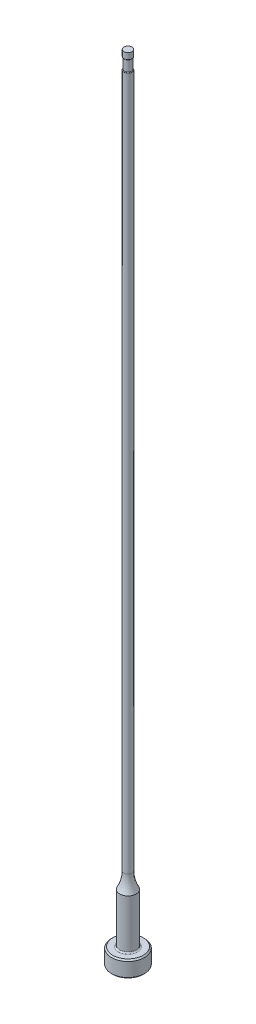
ISO-10303-21;
HEADER;
FILE_DESCRIPTION(('STEP AP214'),'2;1');
FILE_NAME('part.step','',(''),(''),'','','');
FILE_SCHEMA(('AUTOMOTIVE_DESIGN { 1 0 10303 214 1 1 1 1 }'));
ENDSEC;
DATA;
#1=APPLICATION_CONTEXT('core data for automotive mechanical design processes');
#2=APPLICATION_PROTOCOL_DEFINITION('international standard','automotive_design',2000,#1);
#3=PRODUCT_CONTEXT('',#1,'mechanical');
#4=PRODUCT('Part','Part','',(#3));
#5=PRODUCT_RELATED_PRODUCT_CATEGORY('part','',(#4));
#6=PRODUCT_DEFINITION_FORMATION('','',#4);
#7=PRODUCT_DEFINITION_CONTEXT('part definition',#1,'design');
#8=PRODUCT_DEFINITION('design','',#6,#7);
#9=PRODUCT_DEFINITION_SHAPE('','',#8);
#10=(LENGTH_UNIT() NAMED_UNIT(*) SI_UNIT(.MILLI.,.METRE.));
#11=(NAMED_UNIT(*) PLANE_ANGLE_UNIT() SI_UNIT($,.RADIAN.));
#12=(NAMED_UNIT(*) SI_UNIT($,.STERADIAN.) SOLID_ANGLE_UNIT());
#13=UNCERTAINTY_MEASURE_WITH_UNIT(LENGTH_MEASURE(1.E-05),#10,'distance_accuracy_value','');
#14=(GEOMETRIC_REPRESENTATION_CONTEXT(3) GLOBAL_UNCERTAINTY_ASSIGNED_CONTEXT((#13)) GLOBAL_UNIT_ASSIGNED_CONTEXT((#10,
#11,#12)) REPRESENTATION_CONTEXT('',''));
#15=CARTESIAN_POINT('',(0.,0.,0.));
#16=DIRECTION('',(0.,0.,1.));
#17=DIRECTION('',(1.,0.,0.));
#18=AXIS2_PLACEMENT_3D('',#15,#16,#17);
#19=CARTESIAN_POINT('',(0.,259.958771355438,0.));
#20=DIRECTION('',(0.,1.,0.));
#21=DIRECTION('',(0.,0.,1.));
#22=AXIS2_PLACEMENT_3D('',#19,#20,#21);
#23=CYLINDRICAL_SURFACE('',#22,0.79374999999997);
#24=DIRECTION('',(0.,1.,0.));
#25=VECTOR('',#24,1.);
#26=CARTESIAN_POINT('',(-0.692149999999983,259.958771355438,-0.388545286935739));
#27=LINE('',#26,#25);
#28=CARTESIAN_POINT('',(-0.692149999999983,148.973565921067,-0.388545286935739));
#29=VERTEX_POINT('',#28);
#30=CARTESIAN_POINT('',(-0.692149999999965,112.014,-0.388545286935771));
#31=VERTEX_POINT('',#30);
#32=EDGE_CURVE('E66',#29,#31,#27,.F.);
#33=ORIENTED_EDGE('',*,*,#32,.F.);
#34=CARTESIAN_POINT('',(0.,148.973565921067,0.));
#35=DIRECTION('',(0.,1.,0.));
#36=DIRECTION('',(0.,0.,1.));
#37=AXIS2_PLACEMENT_3D('',#34,#35,#36);
#38=CIRCLE('',#37,0.79374999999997);
#39=CARTESIAN_POINT('',(-0.692149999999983,148.973565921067,0.388545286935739));
#40=VERTEX_POINT('',#39);
#41=EDGE_CURVE('E44',#29,#40,#38,.F.);
#42=ORIENTED_EDGE('',*,*,#41,.T.);
#43=DIRECTION('',(0.,1.,0.));
#44=VECTOR('',#43,1.);
#45=CARTESIAN_POINT('',(-0.692149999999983,259.958771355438,0.388545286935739));
#46=LINE('',#45,#44);
#47=CARTESIAN_POINT('',(-0.692149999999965,112.014,0.388545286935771));
#48=VERTEX_POINT('',#47);
#49=EDGE_CURVE('E72',#48,#40,#46,.T.);
#50=ORIENTED_EDGE('',*,*,#49,.F.);
#51=CARTESIAN_POINT('',(-0.692149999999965,112.014,-0.388545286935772));
#52=CARTESIAN_POINT('',(-0.692147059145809,111.980595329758,-0.388529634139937));
#53=CARTESIAN_POINT('',(-0.692677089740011,111.947184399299,-0.387605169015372));
#54=CARTESIAN_POINT('',(-0.694785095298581,111.880441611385,-0.383825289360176));
#55=CARTESIAN_POINT('',(-0.696365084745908,111.847110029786,-0.380966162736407));
#56=CARTESIAN_POINT('',(-0.700560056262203,111.780665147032,-0.373193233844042));
#57=CARTESIAN_POINT('',(-0.703177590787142,111.747552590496,-0.368274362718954));
#58=CARTESIAN_POINT('',(-0.70939790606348,111.681866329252,-0.356147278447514));
#59=CARTESIAN_POINT('',(-0.712999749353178,111.649292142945,-0.348941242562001));
#60=CARTESIAN_POINT('',(-0.720516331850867,111.589629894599,-0.333107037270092));
#61=CARTESIAN_POINT('',(-0.724309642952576,111.562432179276,-0.324837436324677));
#62=CARTESIAN_POINT('',(-0.732469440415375,111.508890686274,-0.305996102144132));
#63=CARTESIAN_POINT('',(-0.736836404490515,111.482547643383,-0.295422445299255));
#64=CARTESIAN_POINT('',(-0.746025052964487,111.430994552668,-0.271391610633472));
#65=CARTESIAN_POINT('',(-0.75085027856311,111.405796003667,-0.257910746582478));
#66=CARTESIAN_POINT('',(-0.760636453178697,111.357650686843,-0.227438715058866));
#67=CARTESIAN_POINT('',(-0.765596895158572,111.334696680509,-0.210459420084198));
#68=CARTESIAN_POINT('',(-0.772863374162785,111.302559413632,-0.181185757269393));
#69=CARTESIAN_POINT('',(-0.775317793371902,111.291987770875,-0.170459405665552));
#70=CARTESIAN_POINT('',(-0.779981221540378,111.272302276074,-0.147661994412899));
#71=CARTESIAN_POINT('',(-0.782190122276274,111.263189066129,-0.135590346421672));
#72=CARTESIAN_POINT('',(-0.786212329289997,111.24684932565,-0.10990918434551));
#73=CARTESIAN_POINT('',(-0.788019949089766,111.239649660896,-0.0962812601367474));
#74=CARTESIAN_POINT('',(-0.790974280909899,111.227994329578,-0.0678329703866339));
#75=CARTESIAN_POINT('',(-0.792122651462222,111.223531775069,-0.0530157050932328));
#76=CARTESIAN_POINT('',(-0.793477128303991,111.218282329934,-0.0246588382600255));
#77=CARTESIAN_POINT('',(-0.793785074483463,111.217097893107,-0.0111986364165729));
#78=CARTESIAN_POINT('',(-0.793708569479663,111.217392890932,0.0156909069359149));
#79=CARTESIAN_POINT('',(-0.793324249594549,111.218871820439,0.0291202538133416));
#80=CARTESIAN_POINT('',(-0.792034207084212,111.223877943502,0.0533347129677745));
#81=CARTESIAN_POINT('',(-0.791220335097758,111.227045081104,0.064202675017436));
#82=CARTESIAN_POINT('',(-0.789221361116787,111.234900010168,0.0853309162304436));
#83=CARTESIAN_POINT('',(-0.78803617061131,111.239588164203,0.0955910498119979));
#84=CARTESIAN_POINT('',(-0.784691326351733,111.252986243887,0.120537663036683));
#85=CARTESIAN_POINT('',(-0.782345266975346,111.262520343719,0.134755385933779));
#86=CARTESIAN_POINT('',(-0.777271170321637,111.283662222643,0.161475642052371));
#87=CARTESIAN_POINT('',(-0.774542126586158,111.295275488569,0.173973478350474));
#88=CARTESIAN_POINT('',(-0.76709792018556,111.327902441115,0.204925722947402));
#89=CARTESIAN_POINT('',(-0.762235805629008,111.350152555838,0.222031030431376));
#90=CARTESIAN_POINT('',(-0.752599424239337,111.396926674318,0.252764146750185));
#91=CARTESIAN_POINT('',(-0.747825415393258,111.421456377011,0.26638290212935));
#92=CARTESIAN_POINT('',(-0.734693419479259,111.493796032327,0.30145019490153));
#93=CARTESIAN_POINT('',(-0.726816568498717,111.543351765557,0.319450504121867));
#94=CARTESIAN_POINT('',(-0.713277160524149,111.644727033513,0.348596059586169));
#95=CARTESIAN_POINT('',(-0.707621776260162,111.696553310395,0.359719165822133));
#96=CARTESIAN_POINT('',(-0.699557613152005,111.792820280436,0.375130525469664));
#97=CARTESIAN_POINT('',(-0.696772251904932,111.837103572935,0.380231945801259));
#98=CARTESIAN_POINT('',(-0.693072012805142,111.925601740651,0.386898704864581));
#99=CARTESIAN_POINT('',(-0.692139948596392,111.969813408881,0.388496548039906));
#100=CARTESIAN_POINT('',(-0.692149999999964,112.014,0.388545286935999));
#101=B_SPLINE_CURVE_WITH_KNOTS('',3,(#51,#52,#53,#54,#55,#56,#57,#58,#59,#60,#61,#62,#63,#64,
#65,#66,#67,#68,#69,#70,#71,#72,#73,#74,#75,#76,#77,#78,#79,#80,#81,#82,#83,#84,#85,#86,#87,#88,
#89,#90,#91,#92,#93,#94,#95,#96,#97,#98,#99,#100),.UNSPECIFIED.,.F.,.F.,(4,2,2,2,2,2,2,2,2,2,2,
2,2,2,2,2,2,2,2,2,2,2,2,2,4),(0.,0.100207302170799,0.20060742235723,0.30125608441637,
0.401809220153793,0.487757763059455,0.573778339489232,0.660528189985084,0.746988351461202,
0.792665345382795,0.838362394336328,0.884670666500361,0.930861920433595,0.971137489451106,
1.01140542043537,1.04531885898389,1.0792403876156,1.13077999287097,1.1824576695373,
1.26742509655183,1.35261096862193,1.51165072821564,1.67119985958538,1.80500866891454,
1.93757071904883),.UNSPECIFIED.);
#102=EDGE_CURVE('E74',#31,#48,#101,.T.);
#103=ORIENTED_EDGE('',*,*,#102,.F.);
#104=EDGE_LOOP('',(#33,#42,#50,#103));
#105=FACE_BOUND('',#104,.T.);
#106=CARTESIAN_POINT('',(0.,15.7741805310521,0.));
#107=DIRECTION('',(0.,1.,0.));
#108=DIRECTION('',(0.,0.,1.));
#109=AXIS2_PLACEMENT_3D('',#106,#107,#108);
#110=CIRCLE('',#109,0.79374999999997);
#111=CARTESIAN_POINT('',(0.,15.7741805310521,0.79374999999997));
#112=VERTEX_POINT('',#111);
#113=EDGE_CURVE('E95',#112,#112,#110,.T.);
#114=ORIENTED_EDGE('',*,*,#113,.T.);
#115=EDGE_LOOP('',(#114));
#116=FACE_BOUND('',#115,.T.);
#117=ADVANCED_FACE('F36',(#105,#116),#23,.T.);
#118=CARTESIAN_POINT('',(0.,15.7741805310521,0.));
#119=DIRECTION('',(0.,1.,0.));
#120=DIRECTION('',(0.,0.,1.));
#121=AXIS2_PLACEMENT_3D('',#118,#119,#120);
#122=TOROIDAL_SURFACE('',#121,7.14374999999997,6.35);
#123=CARTESIAN_POINT('',(0.,12.7,0.));
#124=DIRECTION('',(0.,1.,0.));
#125=DIRECTION('',(0.,0.,1.));
#126=AXIS2_PLACEMENT_3D('',#123,#124,#125);
#127=CIRCLE('',#126,1.58749999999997);
#128=CARTESIAN_POINT('',(0.,12.7,1.58749999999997));
#129=VERTEX_POINT('',#128);
#130=EDGE_CURVE('E92',#129,#129,#127,.T.);
#131=ORIENTED_EDGE('',*,*,#130,.T.);
#132=EDGE_LOOP('',(#131));
#133=FACE_BOUND('',#132,.T.);
#134=ORIENTED_EDGE('',*,*,#113,.F.);
#135=EDGE_LOOP('',(#134));
#136=FACE_BOUND('',#135,.T.);
#137=ADVANCED_FACE('F156',(#133,#136),#122,.F.);
#138=CARTESIAN_POINT('',(0.,259.958771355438,0.));
#139=DIRECTION('',(0.,1.,0.));
#140=DIRECTION('',(0.,0.,1.));
#141=AXIS2_PLACEMENT_3D('',#138,#139,#140);
#142=CYLINDRICAL_SURFACE('',#141,1.58749999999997);
#143=CARTESIAN_POINT('',(0.,3.42900000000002,0.));
#144=DIRECTION('',(0.,1.,0.));
#145=DIRECTION('',(0.,0.,1.));
#146=AXIS2_PLACEMENT_3D('',#143,#144,#145);
#147=CIRCLE('',#146,1.58749999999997);
#148=CARTESIAN_POINT('',(0.,3.42900000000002,1.58749999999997));
#149=VERTEX_POINT('',#148);
#150=EDGE_CURVE('E110',#149,#149,#147,.T.);
#151=ORIENTED_EDGE('',*,*,#150,.T.);
#152=EDGE_LOOP('',(#151));
#153=FACE_BOUND('',#152,.T.);
#154=ORIENTED_EDGE('',*,*,#130,.F.);
#155=EDGE_LOOP('',(#154));
#156=FACE_BOUND('',#155,.T.);
#157=ADVANCED_FACE('F153',(#153,#156),#142,.T.);
#158=CARTESIAN_POINT('',(-3.17499999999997,3.175,0.));
#159=DIRECTION('',(0.,1.,0.));
#160=DIRECTION('',(0.,0.,1.));
#161=AXIS2_PLACEMENT_3D('',#158,#159,#160);
#162=PLANE('',#161);
#163=CARTESIAN_POINT('',(0.,3.175,0.));
#164=DIRECTION('',(0.,1.,0.));
#165=DIRECTION('',(0.,0.,1.));
#166=AXIS2_PLACEMENT_3D('',#163,#164,#165);
#167=CIRCLE('',#166,1.84149999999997);
#168=CARTESIAN_POINT('',(0.,3.175,1.84149999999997));
#169=VERTEX_POINT('',#168);
#170=EDGE_CURVE('E78',#169,#169,#167,.F.);
#171=ORIENTED_EDGE('',*,*,#170,.T.);
#172=EDGE_LOOP('',(#171));
#173=FACE_BOUND('',#172,.T.);
#174=CARTESIAN_POINT('',(0.,3.175,0.));
#175=DIRECTION('',(0.,1.,0.));
#176=DIRECTION('',(0.,0.,1.));
#177=AXIS2_PLACEMENT_3D('',#174,#175,#176);
#178=CIRCLE('',#177,2.92099999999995);
#179=CARTESIAN_POINT('',(0.,3.175,2.92099999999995));
#180=VERTEX_POINT('',#179);
#181=EDGE_CURVE('E98',#180,#180,#178,.T.);
#182=ORIENTED_EDGE('',*,*,#181,.T.);
#183=EDGE_LOOP('',(#182));
#184=FACE_BOUND('',#183,.T.);
#185=ADVANCED_FACE('F149',(#173,#184),#162,.T.);
#186=CARTESIAN_POINT('',(0.,259.958771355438,0.));
#187=DIRECTION('',(0.,1.,0.));
#188=DIRECTION('',(0.,0.,1.));
#189=AXIS2_PLACEMENT_3D('',#186,#187,#188);
#190=CYLINDRICAL_SURFACE('',#189,3.17499999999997);
#191=CARTESIAN_POINT('',(0.,2.92100000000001,0.));
#192=DIRECTION('',(0.,1.,0.));
#193=DIRECTION('',(0.,0.,1.));
#194=AXIS2_PLACEMENT_3D('',#191,#192,#193);
#195=CIRCLE('',#194,3.17499999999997);
#196=CARTESIAN_POINT('',(0.,2.92100000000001,3.17499999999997));
#197=VERTEX_POINT('',#196);
#198=EDGE_CURVE('E104',#197,#197,#195,.F.);
#199=ORIENTED_EDGE('',*,*,#198,.T.);
#200=EDGE_LOOP('',(#199));
#201=FACE_BOUND('',#200,.T.);
#202=CARTESIAN_POINT('',(0.,0.254000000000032,0.));
#203=DIRECTION('',(0.,-1.,0.));
#204=DIRECTION('',(0.,0.,-1.));
#205=AXIS2_PLACEMENT_3D('',#202,#203,#204);
#206=CIRCLE('',#205,3.17499999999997);
#207=CARTESIAN_POINT('',(0.,0.254000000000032,-3.17499999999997));
#208=VERTEX_POINT('',#207);
#209=EDGE_CURVE('E101',#208,#208,#206,.F.);
#210=ORIENTED_EDGE('',*,*,#209,.T.);
#211=EDGE_LOOP('',(#210));
#212=FACE_BOUND('',#211,.T.);
#213=ADVANCED_FACE('F145',(#201,#212),#190,.T.);
#214=CARTESIAN_POINT('',(0.,0.,0.));
#215=DIRECTION('',(0.,-1.,0.));
#216=DIRECTION('',(0.,0.,-1.));
#217=AXIS2_PLACEMENT_3D('',#214,#215,#216);
#218=PLANE('',#217);
#219=CARTESIAN_POINT('',(0.,0.,0.));
#220=DIRECTION('',(0.,-1.,0.));
#221=DIRECTION('',(0.,0.,-1.));
#222=AXIS2_PLACEMENT_3D('',#219,#220,#221);
#223=CIRCLE('',#222,2.92099999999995);
#224=CARTESIAN_POINT('',(0.,0.,-2.92099999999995));
#225=VERTEX_POINT('',#224);
#226=EDGE_CURVE('E107',#225,#225,#223,.T.);
#227=ORIENTED_EDGE('',*,*,#226,.T.);
#228=EDGE_LOOP('',(#227));
#229=FACE_BOUND('',#228,.T.);
#230=ADVANCED_FACE('F141',(#229),#218,.T.);
#231=CARTESIAN_POINT('',(0.,3.17499999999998,0.));
#232=DIRECTION('',(0.,-1.,0.));
#233=DIRECTION('',(0.,0.,-1.));
#234=AXIS2_PLACEMENT_3D('',#231,#232,#233);
#235=CONICAL_SURFACE('',#234,2.92099999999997,0.7853981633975);
#236=ORIENTED_EDGE('',*,*,#198,.F.);
#237=EDGE_LOOP('',(#236));
#238=FACE_BOUND('',#237,.T.);
#239=ORIENTED_EDGE('',*,*,#181,.F.);
#240=EDGE_LOOP('',(#239));
#241=FACE_BOUND('',#240,.T.);
#242=ADVANCED_FACE('F144',(#238,#241),#235,.T.);
#243=CARTESIAN_POINT('',(0.,0.254000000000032,0.));
#244=DIRECTION('',(0.,1.,0.));
#245=DIRECTION('',(0.,0.,1.));
#246=AXIS2_PLACEMENT_3D('',#243,#244,#245);
#247=CONICAL_SURFACE('',#246,3.17499999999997,0.785398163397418);
#248=ORIENTED_EDGE('',*,*,#226,.F.);
#249=EDGE_LOOP('',(#248));
#250=FACE_BOUND('',#249,.T.);
#251=ORIENTED_EDGE('',*,*,#209,.F.);
#252=EDGE_LOOP('',(#251));
#253=FACE_BOUND('',#252,.T.);
#254=ADVANCED_FACE('F245',(#250,#253),#247,.T.);
#255=CARTESIAN_POINT('',(0.,3.42900000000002,0.));
#256=DIRECTION('',(0.,1.,0.));
#257=DIRECTION('',(0.,0.,1.));
#258=AXIS2_PLACEMENT_3D('',#255,#256,#257);
#259=TOROIDAL_SURFACE('',#258,1.84149999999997,0.254);
#260=ORIENTED_EDGE('',*,*,#170,.F.);
#261=EDGE_LOOP('',(#260));
#262=FACE_BOUND('',#261,.T.);
#263=ORIENTED_EDGE('',*,*,#150,.F.);
#264=EDGE_LOOP('',(#263));
#265=FACE_BOUND('',#264,.T.);
#266=ADVANCED_FACE('F139',(#262,#265),#259,.F.);
#267=CARTESIAN_POINT('',(0.,153.448281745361,0.));
#268=DIRECTION('',(0.,1.,0.));
#269=DIRECTION('',(0.,0.,1.));
#270=AXIS2_PLACEMENT_3D('',#267,#268,#269);
#271=CYLINDRICAL_SURFACE('',#270,0.69214999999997);
#272=CARTESIAN_POINT('',(0.,151.13,0.));
#273=DIRECTION('',(0.,1.,0.));
#274=DIRECTION('',(0.,0.,1.));
#275=AXIS2_PLACEMENT_3D('',#272,#273,#274);
#276=CIRCLE('',#275,0.69214999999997);
#277=CARTESIAN_POINT('',(0.,151.13,0.69214999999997));
#278=VERTEX_POINT('',#277);
#279=EDGE_CURVE('E71',#278,#278,#276,.T.);
#280=ORIENTED_EDGE('',*,*,#279,.F.);
#281=EDGE_LOOP('',(#280));
#282=FACE_BOUND('',#281,.T.);
#283=CARTESIAN_POINT('',(0.,149.098,0.));
#284=DIRECTION('',(0.,1.,0.));
#285=DIRECTION('',(0.,0.,1.));
#286=AXIS2_PLACEMENT_3D('',#283,#284,#285);
#287=CIRCLE('',#286,0.69214999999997);
#288=CARTESIAN_POINT('',(-0.69214999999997,149.098,0.));
#289=VERTEX_POINT('',#288);
#290=EDGE_CURVE('E89',#289,#289,#287,.T.);
#291=ORIENTED_EDGE('',*,*,#290,.T.);
#292=EDGE_LOOP('',(#291));
#293=FACE_BOUND('',#292,.T.);
#294=ADVANCED_FACE('F136',(#282,#293),#271,.T.);
#295=CARTESIAN_POINT('',(-0.69214999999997,150.114,-3.17499999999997));
#296=DIRECTION('',(1.,0.,0.));
#297=DIRECTION('',(0.,1.,0.));
#298=AXIS2_PLACEMENT_3D('',#295,#296,#297);
#299=PLANE('',#298);
#300=CARTESIAN_POINT('',(-0.692149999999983,148.973565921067,0.388545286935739));
#301=CARTESIAN_POINT('',(-0.692149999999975,148.977289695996,0.38855392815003));
#302=CARTESIAN_POINT('',(-0.692149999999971,148.981004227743,0.388211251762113));
#303=CARTESIAN_POINT('',(-0.692149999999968,148.988289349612,0.386898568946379));
#304=CARTESIAN_POINT('',(-0.692149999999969,148.991860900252,0.38593396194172));
#305=CARTESIAN_POINT('',(-0.69214999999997,148.998791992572,0.383453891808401));
#306=CARTESIAN_POINT('',(-0.69214999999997,149.00215209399,0.381939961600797));
#307=CARTESIAN_POINT('',(-0.69214999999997,149.00863226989,0.378456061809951));
#308=CARTESIAN_POINT('',(-0.69214999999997,149.011751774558,0.376485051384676));
#309=CARTESIAN_POINT('',(-0.69214999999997,149.01966563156,0.370784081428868));
#310=CARTESIAN_POINT('',(-0.69214999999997,149.024235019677,0.366742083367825));
#311=CARTESIAN_POINT('',(-0.69214999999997,149.032692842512,0.358002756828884));
#312=CARTESIAN_POINT('',(-0.69214999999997,149.036579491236,0.353303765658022));
#313=CARTESIAN_POINT('',(-0.69214999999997,149.046363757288,0.339903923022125));
#314=CARTESIAN_POINT('',(-0.69214999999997,149.051670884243,0.330775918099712));
#315=CARTESIAN_POINT('',(-0.69214999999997,149.060938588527,0.311873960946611));
#316=CARTESIAN_POINT('',(-0.69214999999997,149.064895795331,0.302098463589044));
#317=CARTESIAN_POINT('',(-0.69214999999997,149.07335470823,0.277716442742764));
#318=CARTESIAN_POINT('',(-0.69214999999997,149.07729702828,0.262919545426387));
#319=CARTESIAN_POINT('',(-0.69214999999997,149.083750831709,0.233007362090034));
#320=CARTESIAN_POINT('',(-0.69214999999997,149.086258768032,0.21789138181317));
#321=CARTESIAN_POINT('',(-0.69214999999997,149.092375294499,0.172181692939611));
#322=CARTESIAN_POINT('',(-0.69214999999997,149.094529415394,0.141404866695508));
#323=CARTESIAN_POINT('',(-0.69214999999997,149.096692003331,0.0920701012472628));
#324=CARTESIAN_POINT('',(-0.69214999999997,149.097212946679,0.0735164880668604));
#325=CARTESIAN_POINT('',(-0.69214999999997,149.097853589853,0.0366435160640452));
#326=CARTESIAN_POINT('',(-0.69214999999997,149.097978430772,0.0183242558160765));
#327=CARTESIAN_POINT('',(-0.69214999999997,149.098,0.));
#328=B_SPLINE_CURVE_WITH_KNOTS('',3,(#300,#301,#302,#303,#304,#305,#306,#307,#308,#309,#310,
#311,#312,#313,#314,#315,#316,#317,#318,#319,#320,#321,#322,#323,#324,#325,#326,#327),
.UNSPECIFIED.,.F.,.F.,(4,2,2,2,2,2,2,2,2,2,2,2,2,4),(0.,0.0111408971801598,0.0221863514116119,
0.0332012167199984,0.0442414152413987,0.0624374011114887,0.0806802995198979,0.112177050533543,
0.143751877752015,0.189567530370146,0.235495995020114,0.327902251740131,0.383589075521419,
0.438550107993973),.UNSPECIFIED.);
#329=EDGE_CURVE('E77',#40,#289,#328,.T.);
#330=ORIENTED_EDGE('',*,*,#329,.T.);
#331=CARTESIAN_POINT('',(-0.69214999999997,149.098,0.));
#332=CARTESIAN_POINT('',(-0.69214999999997,149.097997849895,-0.0105245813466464));
#333=CARTESIAN_POINT('',(-0.69214999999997,149.097951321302,-0.0210488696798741));
#334=CARTESIAN_POINT('',(-0.69214999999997,149.09775049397,-0.0420982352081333));
#335=CARTESIAN_POINT('',(-0.69214999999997,149.097596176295,-0.0526233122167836));
#336=CARTESIAN_POINT('',(-0.69214999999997,149.096939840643,-0.0843503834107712));
#337=CARTESIAN_POINT('',(-0.69214999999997,149.096243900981,-0.105550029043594));
#338=CARTESIAN_POINT('',(-0.69214999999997,149.093914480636,-0.148128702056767));
#339=CARTESIAN_POINT('',(-0.69214999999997,149.092271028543,-0.169507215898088));
#340=CARTESIAN_POINT('',(-0.69214999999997,149.087296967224,-0.212034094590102));
#341=CARTESIAN_POINT('',(-0.69214999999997,149.08397232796,-0.233183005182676));
#342=CARTESIAN_POINT('',(-0.69214999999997,149.077208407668,-0.262553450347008));
#343=CARTESIAN_POINT('',(-0.69214999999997,149.074990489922,-0.27105086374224));
#344=CARTESIAN_POINT('',(-0.69214999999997,149.069911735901,-0.287887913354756));
#345=CARTESIAN_POINT('',(-0.69214999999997,149.067048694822,-0.296226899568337));
#346=CARTESIAN_POINT('',(-0.69214999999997,149.059703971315,-0.314648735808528));
#347=CARTESIAN_POINT('',(-0.69214999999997,149.054996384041,-0.324643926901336));
#348=CARTESIAN_POINT('',(-0.69214999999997,149.043902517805,-0.343648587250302));
#349=CARTESIAN_POINT('',(-0.69214999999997,149.037528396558,-0.352664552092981));
#350=CARTESIAN_POINT('',(-0.69214999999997,149.027016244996,-0.363960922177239));
#351=CARTESIAN_POINT('',(-0.69214999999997,149.023779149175,-0.367075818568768));
#352=CARTESIAN_POINT('',(-0.69214999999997,149.016910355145,-0.372849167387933));
#353=CARTESIAN_POINT('',(-0.69214999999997,149.013278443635,-0.375507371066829));
#354=CARTESIAN_POINT('',(-0.69214999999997,149.005582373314,-0.380238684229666));
#355=CARTESIAN_POINT('',(-0.69214999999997,149.00151340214,-0.382304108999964));
#356=CARTESIAN_POINT('',(-0.69214999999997,148.993058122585,-0.385614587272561));
#357=CARTESIAN_POINT('',(-0.69214999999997,148.988672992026,-0.386862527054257));
#358=CARTESIAN_POINT('',(-0.69214999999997,148.982454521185,-0.387934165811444));
#359=CARTESIAN_POINT('',(-0.69214999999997,148.980685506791,-0.388162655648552));
#360=CARTESIAN_POINT('',(-0.69214999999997,148.977133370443,-0.388468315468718));
#361=CARTESIAN_POINT('',(-0.69214999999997,148.9753502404,-0.388545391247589));
#362=CARTESIAN_POINT('',(-0.69214999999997,148.973565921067,-0.388545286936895));
#363=B_SPLINE_CURVE_WITH_KNOTS('',3,(#331,#332,#333,#334,#335,#336,#337,#338,#339,#340,#341,
#342,#343,#344,#345,#346,#347,#348,#349,#350,#351,#352,#353,#354,#355,#356,#357,#358,#359,#360,
#361,#362),.UNSPECIFIED.,.F.,.F.,(4,2,2,2,2,2,2,2,2,2,2,2,2,2,2,4),(0.,0.0315729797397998,
0.0631515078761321,0.126771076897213,0.191072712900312,0.255147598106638,0.281475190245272,
0.307894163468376,0.340944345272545,0.373759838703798,0.38720552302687,0.400658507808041,
0.414278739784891,0.427850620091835,0.433196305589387,0.438545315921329),.UNSPECIFIED.);
#364=EDGE_CURVE('E58',#289,#29,#363,.T.);
#365=ORIENTED_EDGE('',*,*,#364,.T.);
#366=ORIENTED_EDGE('',*,*,#32,.T.);
#367=DIRECTION('',(0.,0.,1.));
#368=VECTOR('',#367,1.);
#369=CARTESIAN_POINT('',(-0.692149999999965,112.014,-3.17499999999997));
#370=LINE('',#369,#368);
#371=EDGE_CURVE('E70',#31,#48,#370,.T.);
#372=ORIENTED_EDGE('',*,*,#371,.T.);
#373=ORIENTED_EDGE('',*,*,#49,.T.);
#374=EDGE_LOOP('',(#330,#365,#366,#372,#373));
#375=FACE_BOUND('',#374,.T.);
#376=ADVANCED_FACE('F68',(#375),#299,.F.);
#377=CARTESIAN_POINT('',(-3.86714999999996,112.014,-3.17499999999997));
#378=DIRECTION('',(0.,0.,1.));
#379=DIRECTION('',(1.,0.,0.));
#380=AXIS2_PLACEMENT_3D('',#377,#378,#379);
#381=CYLINDRICAL_SURFACE('',#380,3.175);
#382=ORIENTED_EDGE('',*,*,#371,.F.);
#383=ORIENTED_EDGE('',*,*,#102,.T.);
#384=EDGE_LOOP('',(#382,#383));
#385=FACE_BOUND('',#384,.T.);
#386=ADVANCED_FACE('F80',(#385),#381,.F.);
#387=CARTESIAN_POINT('',(0.,152.687735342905,0.));
#388=DIRECTION('',(0.,1.,0.));
#389=DIRECTION('',(0.,0.,1.));
#390=AXIS2_PLACEMENT_3D('',#387,#388,#389);
#391=CYLINDRICAL_SURFACE('',#390,0.78104999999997);
#392=CARTESIAN_POINT('',(0.,151.25115027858,0.));
#393=DIRECTION('',(0.,-1.,0.));
#394=DIRECTION('',(0.,0.,-1.));
#395=AXIS2_PLACEMENT_3D('',#392,#393,#394);
#396=CIRCLE('',#395,0.78104999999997);
#397=CARTESIAN_POINT('',(0.,151.25115027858,-0.78104999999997));
#398=VERTEX_POINT('',#397);
#399=EDGE_CURVE('E11',#398,#398,#396,.F.);
#400=ORIENTED_EDGE('',*,*,#399,.T.);
#401=EDGE_LOOP('',(#400));
#402=FACE_BOUND('',#401,.T.);
#403=CARTESIAN_POINT('',(0.,152.4,0.));
#404=DIRECTION('',(0.,1.,0.));
#405=DIRECTION('',(0.,0.,1.));
#406=AXIS2_PLACEMENT_3D('',#403,#404,#405);
#407=CIRCLE('',#406,0.78104999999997);
#408=CARTESIAN_POINT('',(0.,152.4,0.78104999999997));
#409=VERTEX_POINT('',#408);
#410=EDGE_CURVE('E81',#409,#409,#407,.T.);
#411=ORIENTED_EDGE('',*,*,#410,.F.);
#412=EDGE_LOOP('',(#411));
#413=FACE_BOUND('',#412,.T.);
#414=ADVANCED_FACE('F133',(#402,#413),#391,.T.);
#415=CARTESIAN_POINT('',(-0.79374999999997,152.4,0.));
#416=DIRECTION('',(0.,1.,0.));
#417=DIRECTION('',(0.,0.,1.));
#418=AXIS2_PLACEMENT_3D('',#415,#416,#417);
#419=PLANE('',#418);
#420=ORIENTED_EDGE('',*,*,#410,.T.);
#421=EDGE_LOOP('',(#420));
#422=FACE_BOUND('',#421,.T.);
#423=ADVANCED_FACE('F177',(#422),#419,.T.);
#424=CARTESIAN_POINT('',(0.,148.973565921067,0.));
#425=DIRECTION('',(0.,1.,0.));
#426=DIRECTION('',(0.,0.,1.));
#427=AXIS2_PLACEMENT_3D('',#424,#425,#426);
#428=TOROIDAL_SURFACE('',#427,0.66674999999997,0.127);
#429=ORIENTED_EDGE('',*,*,#329,.F.);
#430=ORIENTED_EDGE('',*,*,#41,.F.);
#431=ORIENTED_EDGE('',*,*,#364,.F.);
#432=ORIENTED_EDGE('',*,*,#290,.F.);
#433=EDGE_LOOP('',(#429,#430,#431,#432));
#434=FACE_BOUND('',#433,.T.);
#435=ADVANCED_FACE('F209',(#434),#428,.T.);
#436=CARTESIAN_POINT('',(0.,151.25115027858,0.));
#437=DIRECTION('',(0.,-1.,0.));
#438=DIRECTION('',(0.,0.,-1.));
#439=AXIS2_PLACEMENT_3D('',#436,#437,#438);
#440=TOROIDAL_SURFACE('',#439,0.65404999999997,0.127);
#441=ORIENTED_EDGE('',*,*,#279,.T.);
#442=EDGE_LOOP('',(#441));
#443=FACE_BOUND('',#442,.T.);
#444=ORIENTED_EDGE('',*,*,#399,.F.);
#445=EDGE_LOOP('',(#444));
#446=FACE_BOUND('',#445,.T.);
#447=ADVANCED_FACE('F38',(#443,#446),#440,.T.);
#448=CLOSED_SHELL('',(#117,#137,#157,#185,#213,#230,#242,#254,#266,#294,#376,#386,#414,#423,
#435,#447));
#449=MANIFOLD_SOLID_BREP('B2',#448);
#450=ADVANCED_BREP_SHAPE_REPRESENTATION('',(#18,#449),#14);
#451=SHAPE_DEFINITION_REPRESENTATION(#9,#450);
ENDSEC;
END-ISO-10303-21;
